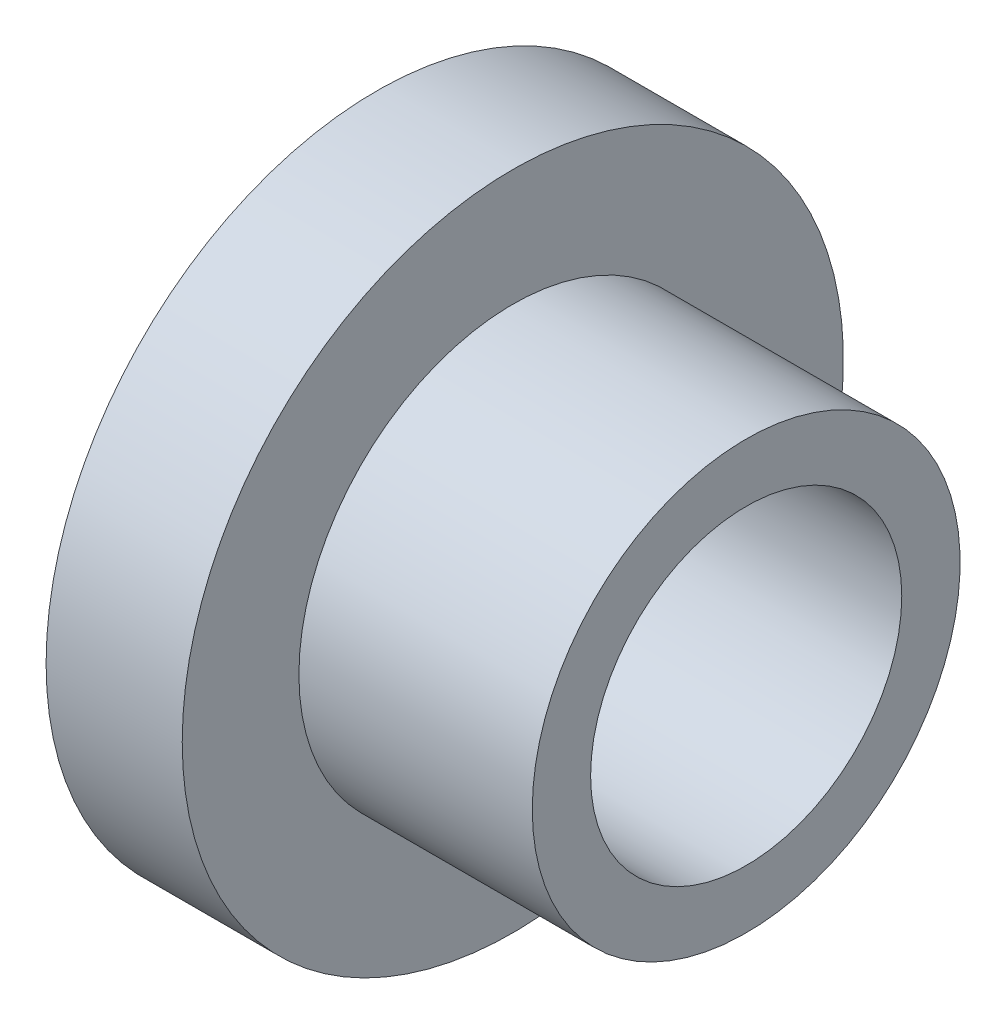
from build123d import *


with BuildPart() as part:
    # Sketch 1 → Revolve 1 (revolve)
    with BuildSketch(Plane.XY, mode=Mode.PRIVATE) as revolve_1_sk:
        Polygon((0, 8), (0, 17), (7, 17), (7, 11), (19, 11), (19, 8), align=None)
    revolve(revolve_1_sk.sketch.rotate(Axis((0, 0, 0), (1, 0, 0)), 90), axis=Axis((0, 0, 0), (1, 0, 0)))


solid = part.part
